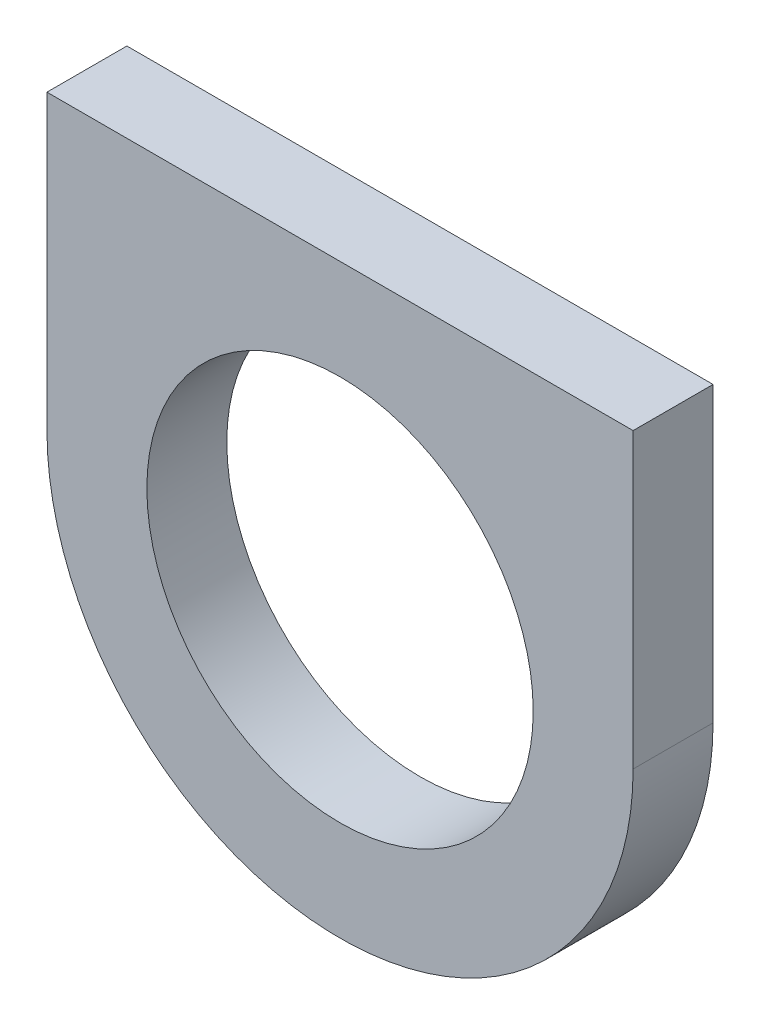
ISO-10303-21;
HEADER;
FILE_DESCRIPTION(('STEP AP214'),'2;1');
FILE_NAME('part.step','',(''),(''),'','','');
FILE_SCHEMA(('AUTOMOTIVE_DESIGN { 1 0 10303 214 1 1 1 1 }'));
ENDSEC;
DATA;
#1=APPLICATION_CONTEXT('core data for automotive mechanical design processes');
#2=APPLICATION_PROTOCOL_DEFINITION('international standard','automotive_design',2000,#1);
#3=PRODUCT_CONTEXT('',#1,'mechanical');
#4=PRODUCT('Part','Part','',(#3));
#5=PRODUCT_RELATED_PRODUCT_CATEGORY('part','',(#4));
#6=PRODUCT_DEFINITION_FORMATION('','',#4);
#7=PRODUCT_DEFINITION_CONTEXT('part definition',#1,'design');
#8=PRODUCT_DEFINITION('design','',#6,#7);
#9=PRODUCT_DEFINITION_SHAPE('','',#8);
#10=(LENGTH_UNIT() NAMED_UNIT(*) SI_UNIT(.MILLI.,.METRE.));
#11=(NAMED_UNIT(*) PLANE_ANGLE_UNIT() SI_UNIT($,.RADIAN.));
#12=(NAMED_UNIT(*) SI_UNIT($,.STERADIAN.) SOLID_ANGLE_UNIT());
#13=UNCERTAINTY_MEASURE_WITH_UNIT(LENGTH_MEASURE(1.E-05),#10,'distance_accuracy_value','');
#14=(GEOMETRIC_REPRESENTATION_CONTEXT(3) GLOBAL_UNCERTAINTY_ASSIGNED_CONTEXT((#13)) GLOBAL_UNIT_ASSIGNED_CONTEXT((#10,
#11,#12)) REPRESENTATION_CONTEXT('',''));
#15=CARTESIAN_POINT('',(0.,0.,0.));
#16=DIRECTION('',(0.,0.,1.));
#17=DIRECTION('',(1.,0.,0.));
#18=AXIS2_PLACEMENT_3D('',#15,#16,#17);
#19=CARTESIAN_POINT('',(0.,0.,30.));
#20=DIRECTION('',(0.,0.,1.));
#21=DIRECTION('',(-1.,0.,0.));
#22=AXIS2_PLACEMENT_3D('',#19,#20,#21);
#23=PLANE('',#22);
#24=CARTESIAN_POINT('',(0.,0.,30.));
#25=DIRECTION('',(0.,0.,-1.));
#26=DIRECTION('',(-1.,0.,0.));
#27=AXIS2_PLACEMENT_3D('',#24,#25,#26);
#28=CIRCLE('',#27,110.);
#29=CARTESIAN_POINT('',(110.,0.,30.));
#30=VERTEX_POINT('',#29);
#31=CARTESIAN_POINT('',(-110.,0.,30.));
#32=VERTEX_POINT('',#31);
#33=EDGE_CURVE('E72',#30,#32,#28,.T.);
#34=ORIENTED_EDGE('',*,*,#33,.F.);
#35=DIRECTION('',(0.,-1.,0.));
#36=VECTOR('',#35,1.);
#37=CARTESIAN_POINT('',(110.,110.,30.));
#38=LINE('',#37,#36);
#39=CARTESIAN_POINT('',(110.,110.,30.));
#40=VERTEX_POINT('',#39);
#41=EDGE_CURVE('E102',#40,#30,#38,.T.);
#42=ORIENTED_EDGE('',*,*,#41,.F.);
#43=DIRECTION('',(1.,0.,0.));
#44=VECTOR('',#43,1.);
#45=CARTESIAN_POINT('',(-110.,110.,30.));
#46=LINE('',#45,#44);
#47=CARTESIAN_POINT('',(-110.,110.,30.));
#48=VERTEX_POINT('',#47);
#49=EDGE_CURVE('E100',#48,#40,#46,.T.);
#50=ORIENTED_EDGE('',*,*,#49,.F.);
#51=DIRECTION('',(0.,1.,0.));
#52=VECTOR('',#51,1.);
#53=CARTESIAN_POINT('',(-110.,0.,30.));
#54=LINE('',#53,#52);
#55=EDGE_CURVE('E98',#32,#48,#54,.T.);
#56=ORIENTED_EDGE('',*,*,#55,.F.);
#57=EDGE_LOOP('',(#34,#42,#50,#56));
#58=FACE_BOUND('',#57,.T.);
#59=CARTESIAN_POINT('',(0.,0.,30.));
#60=DIRECTION('',(0.,0.,-1.));
#61=DIRECTION('',(-1.,0.,0.));
#62=AXIS2_PLACEMENT_3D('',#59,#60,#61);
#63=CIRCLE('',#62,72.5);
#64=CARTESIAN_POINT('',(-72.5,0.,30.));
#65=VERTEX_POINT('',#64);
#66=EDGE_CURVE('E88',#65,#65,#63,.T.);
#67=ORIENTED_EDGE('',*,*,#66,.T.);
#68=EDGE_LOOP('',(#67));
#69=FACE_BOUND('',#68,.T.);
#70=ADVANCED_FACE('F30',(#58,#69),#23,.T.);
#71=CARTESIAN_POINT('',(0.,0.,0.));
#72=DIRECTION('',(0.,0.,1.));
#73=DIRECTION('',(-1.,0.,0.));
#74=AXIS2_PLACEMENT_3D('',#71,#72,#73);
#75=PLANE('',#74);
#76=CARTESIAN_POINT('',(0.,0.,0.));
#77=DIRECTION('',(0.,0.,-1.));
#78=DIRECTION('',(-1.,0.,0.));
#79=AXIS2_PLACEMENT_3D('',#76,#77,#78);
#80=CIRCLE('',#79,110.);
#81=CARTESIAN_POINT('',(110.,0.,0.));
#82=VERTEX_POINT('',#81);
#83=CARTESIAN_POINT('',(-110.,0.,0.));
#84=VERTEX_POINT('',#83);
#85=EDGE_CURVE('E70',#82,#84,#80,.T.);
#86=ORIENTED_EDGE('',*,*,#85,.T.);
#87=DIRECTION('',(0.,1.,0.));
#88=VECTOR('',#87,1.);
#89=CARTESIAN_POINT('',(-110.,0.,0.));
#90=LINE('',#89,#88);
#91=CARTESIAN_POINT('',(-110.,110.,0.));
#92=VERTEX_POINT('',#91);
#93=EDGE_CURVE('E77',#84,#92,#90,.T.);
#94=ORIENTED_EDGE('',*,*,#93,.T.);
#95=DIRECTION('',(1.,0.,0.));
#96=VECTOR('',#95,1.);
#97=CARTESIAN_POINT('',(-110.,110.,0.));
#98=LINE('',#97,#96);
#99=CARTESIAN_POINT('',(110.,110.,0.));
#100=VERTEX_POINT('',#99);
#101=EDGE_CURVE('E82',#92,#100,#98,.T.);
#102=ORIENTED_EDGE('',*,*,#101,.T.);
#103=DIRECTION('',(0.,-1.,0.));
#104=VECTOR('',#103,1.);
#105=CARTESIAN_POINT('',(110.,110.,0.));
#106=LINE('',#105,#104);
#107=EDGE_CURVE('E87',#100,#82,#106,.T.);
#108=ORIENTED_EDGE('',*,*,#107,.T.);
#109=EDGE_LOOP('',(#86,#94,#102,#108));
#110=FACE_BOUND('',#109,.T.);
#111=CARTESIAN_POINT('',(0.,0.,0.));
#112=DIRECTION('',(0.,0.,-1.));
#113=DIRECTION('',(-1.,0.,0.));
#114=AXIS2_PLACEMENT_3D('',#111,#112,#113);
#115=CIRCLE('',#114,72.5);
#116=CARTESIAN_POINT('',(-72.5,0.,0.));
#117=VERTEX_POINT('',#116);
#118=EDGE_CURVE('E91',#117,#117,#115,.T.);
#119=ORIENTED_EDGE('',*,*,#118,.F.);
#120=EDGE_LOOP('',(#119));
#121=FACE_BOUND('',#120,.T.);
#122=ADVANCED_FACE('F85',(#110,#121),#75,.F.);
#123=CARTESIAN_POINT('',(0.,0.,30.));
#124=DIRECTION('',(0.,0.,-1.));
#125=DIRECTION('',(1.,0.,0.));
#126=AXIS2_PLACEMENT_3D('',#123,#124,#125);
#127=CYLINDRICAL_SURFACE('',#126,110.);
#128=ORIENTED_EDGE('',*,*,#85,.F.);
#129=DIRECTION('',(0.,0.,-1.));
#130=VECTOR('',#129,1.);
#131=CARTESIAN_POINT('',(110.,0.,30.));
#132=LINE('',#131,#130);
#133=EDGE_CURVE('E45',#30,#82,#132,.T.);
#134=ORIENTED_EDGE('',*,*,#133,.F.);
#135=ORIENTED_EDGE('',*,*,#33,.T.);
#136=DIRECTION('',(0.,0.,-1.));
#137=VECTOR('',#136,1.);
#138=CARTESIAN_POINT('',(-110.,0.,30.));
#139=LINE('',#138,#137);
#140=EDGE_CURVE('E11',#32,#84,#139,.T.);
#141=ORIENTED_EDGE('',*,*,#140,.T.);
#142=EDGE_LOOP('',(#128,#134,#135,#141));
#143=FACE_BOUND('',#142,.T.);
#144=ADVANCED_FACE('F32',(#143),#127,.T.);
#145=CARTESIAN_POINT('',(-110.,0.,30.));
#146=DIRECTION('',(1.,0.,0.));
#147=DIRECTION('',(0.,0.,1.));
#148=AXIS2_PLACEMENT_3D('',#145,#146,#147);
#149=PLANE('',#148);
#150=ORIENTED_EDGE('',*,*,#93,.F.);
#151=ORIENTED_EDGE('',*,*,#140,.F.);
#152=ORIENTED_EDGE('',*,*,#55,.T.);
#153=DIRECTION('',(0.,0.,-1.));
#154=VECTOR('',#153,1.);
#155=CARTESIAN_POINT('',(-110.,110.,30.));
#156=LINE('',#155,#154);
#157=EDGE_CURVE('E38',#48,#92,#156,.T.);
#158=ORIENTED_EDGE('',*,*,#157,.T.);
#159=EDGE_LOOP('',(#150,#151,#152,#158));
#160=FACE_BOUND('',#159,.T.);
#161=ADVANCED_FACE('F78',(#160),#149,.F.);
#162=CARTESIAN_POINT('',(-110.,110.,30.));
#163=DIRECTION('',(0.,-1.,0.));
#164=DIRECTION('',(-1.,0.,0.));
#165=AXIS2_PLACEMENT_3D('',#162,#163,#164);
#166=PLANE('',#165);
#167=ORIENTED_EDGE('',*,*,#101,.F.);
#168=ORIENTED_EDGE('',*,*,#157,.F.);
#169=ORIENTED_EDGE('',*,*,#49,.T.);
#170=DIRECTION('',(0.,0.,-1.));
#171=VECTOR('',#170,1.);
#172=CARTESIAN_POINT('',(110.,110.,30.));
#173=LINE('',#172,#171);
#174=EDGE_CURVE('E52',#40,#100,#173,.T.);
#175=ORIENTED_EDGE('',*,*,#174,.T.);
#176=EDGE_LOOP('',(#167,#168,#169,#175));
#177=FACE_BOUND('',#176,.T.);
#178=ADVANCED_FACE('F106',(#177),#166,.F.);
#179=CARTESIAN_POINT('',(110.,110.,30.));
#180=DIRECTION('',(-1.,0.,0.));
#181=DIRECTION('',(0.,1.,0.));
#182=AXIS2_PLACEMENT_3D('',#179,#180,#181);
#183=PLANE('',#182);
#184=ORIENTED_EDGE('',*,*,#107,.F.);
#185=ORIENTED_EDGE('',*,*,#174,.F.);
#186=ORIENTED_EDGE('',*,*,#41,.T.);
#187=ORIENTED_EDGE('',*,*,#133,.T.);
#188=EDGE_LOOP('',(#184,#185,#186,#187));
#189=FACE_BOUND('',#188,.T.);
#190=ADVANCED_FACE('F109',(#189),#183,.F.);
#191=CARTESIAN_POINT('',(0.,0.,30.));
#192=DIRECTION('',(0.,0.,-1.));
#193=DIRECTION('',(1.,0.,0.));
#194=AXIS2_PLACEMENT_3D('',#191,#192,#193);
#195=CYLINDRICAL_SURFACE('',#194,72.5);
#196=ORIENTED_EDGE('',*,*,#66,.F.);
#197=EDGE_LOOP('',(#196));
#198=FACE_BOUND('',#197,.T.);
#199=ORIENTED_EDGE('',*,*,#118,.T.);
#200=EDGE_LOOP('',(#199));
#201=FACE_BOUND('',#200,.T.);
#202=ADVANCED_FACE('F116',(#198,#201),#195,.F.);
#203=CLOSED_SHELL('',(#70,#122,#144,#161,#178,#190,#202));
#204=MANIFOLD_SOLID_BREP('B2',#203);
#205=ADVANCED_BREP_SHAPE_REPRESENTATION('',(#18,#204),#14);
#206=SHAPE_DEFINITION_REPRESENTATION(#9,#205);
ENDSEC;
END-ISO-10303-21;
